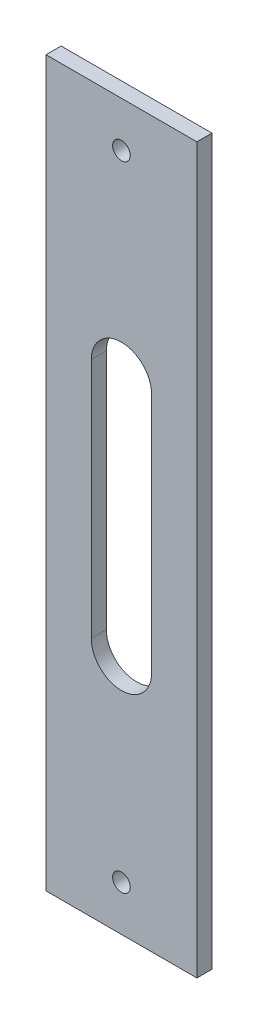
ISO-10303-21;
HEADER;
FILE_DESCRIPTION(('STEP AP214'),'2;1');
FILE_NAME('part.step','',(''),(''),'','','');
FILE_SCHEMA(('AUTOMOTIVE_DESIGN { 1 0 10303 214 1 1 1 1 }'));
ENDSEC;
DATA;
#1=APPLICATION_CONTEXT('core data for automotive mechanical design processes');
#2=APPLICATION_PROTOCOL_DEFINITION('international standard','automotive_design',2000,#1);
#3=PRODUCT_CONTEXT('',#1,'mechanical');
#4=PRODUCT('Part','Part','',(#3));
#5=PRODUCT_RELATED_PRODUCT_CATEGORY('part','',(#4));
#6=PRODUCT_DEFINITION_FORMATION('','',#4);
#7=PRODUCT_DEFINITION_CONTEXT('part definition',#1,'design');
#8=PRODUCT_DEFINITION('design','',#6,#7);
#9=PRODUCT_DEFINITION_SHAPE('','',#8);
#10=(LENGTH_UNIT() NAMED_UNIT(*) SI_UNIT(.MILLI.,.METRE.));
#11=(NAMED_UNIT(*) PLANE_ANGLE_UNIT() SI_UNIT($,.RADIAN.));
#12=(NAMED_UNIT(*) SI_UNIT($,.STERADIAN.) SOLID_ANGLE_UNIT());
#13=UNCERTAINTY_MEASURE_WITH_UNIT(LENGTH_MEASURE(1.E-05),#10,'distance_accuracy_value','');
#14=(GEOMETRIC_REPRESENTATION_CONTEXT(3) GLOBAL_UNCERTAINTY_ASSIGNED_CONTEXT((#13)) GLOBAL_UNIT_ASSIGNED_CONTEXT((#10,
#11,#12)) REPRESENTATION_CONTEXT('',''));
#15=CARTESIAN_POINT('',(0.,0.,0.));
#16=DIRECTION('',(0.,0.,1.));
#17=DIRECTION('',(1.,0.,0.));
#18=AXIS2_PLACEMENT_3D('',#15,#16,#17);
#19=CARTESIAN_POINT('',(7.93749999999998,-38.1,79.4235817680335));
#20=DIRECTION('',(-1.,0.,0.));
#21=DIRECTION('',(0.,0.,1.));
#22=AXIS2_PLACEMENT_3D('',#19,#20,#21);
#23=PLANE('',#22);
#24=DIRECTION('',(0.,1.,0.));
#25=VECTOR('',#24,1.);
#26=CARTESIAN_POINT('',(7.93749999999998,-38.1,1.58749999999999));
#27=LINE('',#26,#25);
#28=CARTESIAN_POINT('',(7.93749999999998,-38.1,1.58749999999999));
#29=VERTEX_POINT('',#28);
#30=CARTESIAN_POINT('',(7.93749999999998,38.1,1.58749999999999));
#31=VERTEX_POINT('',#30);
#32=EDGE_CURVE('E157',#29,#31,#27,.T.);
#33=ORIENTED_EDGE('',*,*,#32,.F.);
#34=DIRECTION('',(0.,0.,-1.));
#35=VECTOR('',#34,1.);
#36=CARTESIAN_POINT('',(7.93749999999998,-38.1,79.4235817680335));
#37=LINE('',#36,#35);
#38=CARTESIAN_POINT('',(7.93749999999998,-38.1,0.));
#39=VERTEX_POINT('',#38);
#40=EDGE_CURVE('E36',#29,#39,#37,.T.);
#41=ORIENTED_EDGE('',*,*,#40,.T.);
#42=DIRECTION('',(0.,1.,0.));
#43=VECTOR('',#42,1.);
#44=CARTESIAN_POINT('',(7.93749999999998,-38.1,0.));
#45=LINE('',#44,#43);
#46=CARTESIAN_POINT('',(7.93749999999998,38.1,0.));
#47=VERTEX_POINT('',#46);
#48=EDGE_CURVE('E152',#39,#47,#45,.T.);
#49=ORIENTED_EDGE('',*,*,#48,.T.);
#50=DIRECTION('',(0.,0.,-1.));
#51=VECTOR('',#50,1.);
#52=CARTESIAN_POINT('',(7.93749999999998,38.1,79.4235817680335));
#53=LINE('',#52,#51);
#54=EDGE_CURVE('E151',#31,#47,#53,.T.);
#55=ORIENTED_EDGE('',*,*,#54,.F.);
#56=EDGE_LOOP('',(#33,#41,#49,#55));
#57=FACE_BOUND('',#56,.T.);
#58=ADVANCED_FACE('F32',(#57),#23,.F.);
#59=CARTESIAN_POINT('',(7.93749999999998,38.1,79.4235817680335));
#60=DIRECTION('',(0.,-1.,0.));
#61=DIRECTION('',(0.,0.,-1.));
#62=AXIS2_PLACEMENT_3D('',#59,#60,#61);
#63=PLANE('',#62);
#64=DIRECTION('',(-1.,0.,0.));
#65=VECTOR('',#64,1.);
#66=CARTESIAN_POINT('',(7.93749999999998,38.1,1.58749999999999));
#67=LINE('',#66,#65);
#68=CARTESIAN_POINT('',(-7.9375,38.1,1.58749999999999));
#69=VERTEX_POINT('',#68);
#70=EDGE_CURVE('E41',#31,#69,#67,.T.);
#71=ORIENTED_EDGE('',*,*,#70,.F.);
#72=ORIENTED_EDGE('',*,*,#54,.T.);
#73=DIRECTION('',(-1.,0.,0.));
#74=VECTOR('',#73,1.);
#75=CARTESIAN_POINT('',(7.93749999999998,38.1,0.));
#76=LINE('',#75,#74);
#77=CARTESIAN_POINT('',(-7.9375,38.1,0.));
#78=VERTEX_POINT('',#77);
#79=EDGE_CURVE('E148',#47,#78,#76,.T.);
#80=ORIENTED_EDGE('',*,*,#79,.T.);
#81=DIRECTION('',(0.,0.,-1.));
#82=VECTOR('',#81,1.);
#83=CARTESIAN_POINT('',(-7.9375,38.1,79.4235817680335));
#84=LINE('',#83,#82);
#85=EDGE_CURVE('E147',#69,#78,#84,.T.);
#86=ORIENTED_EDGE('',*,*,#85,.F.);
#87=EDGE_LOOP('',(#71,#72,#80,#86));
#88=FACE_BOUND('',#87,.T.);
#89=ADVANCED_FACE('F178',(#88),#63,.F.);
#90=CARTESIAN_POINT('',(-7.9375,-38.1,79.4235817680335));
#91=DIRECTION('',(1.,0.,0.));
#92=DIRECTION('',(0.,0.,-1.));
#93=AXIS2_PLACEMENT_3D('',#90,#91,#92);
#94=PLANE('',#93);
#95=DIRECTION('',(0.,-1.,0.));
#96=VECTOR('',#95,1.);
#97=CARTESIAN_POINT('',(-7.9375,-38.1,1.58749999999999));
#98=LINE('',#97,#96);
#99=CARTESIAN_POINT('',(-7.9375,-38.1,1.58749999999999));
#100=VERTEX_POINT('',#99);
#101=EDGE_CURVE('E11',#69,#100,#98,.T.);
#102=ORIENTED_EDGE('',*,*,#101,.F.);
#103=ORIENTED_EDGE('',*,*,#85,.T.);
#104=DIRECTION('',(0.,-1.,0.));
#105=VECTOR('',#104,1.);
#106=CARTESIAN_POINT('',(-7.9375,-38.1,0.));
#107=LINE('',#106,#105);
#108=CARTESIAN_POINT('',(-7.9375,-38.1,0.));
#109=VERTEX_POINT('',#108);
#110=EDGE_CURVE('E144',#78,#109,#107,.T.);
#111=ORIENTED_EDGE('',*,*,#110,.T.);
#112=DIRECTION('',(0.,0.,-1.));
#113=VECTOR('',#112,1.);
#114=CARTESIAN_POINT('',(-7.9375,-38.1,79.4235817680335));
#115=LINE('',#114,#113);
#116=EDGE_CURVE('E143',#100,#109,#115,.T.);
#117=ORIENTED_EDGE('',*,*,#116,.F.);
#118=EDGE_LOOP('',(#102,#103,#111,#117));
#119=FACE_BOUND('',#118,.T.);
#120=ADVANCED_FACE('F170',(#119),#94,.F.);
#121=CARTESIAN_POINT('',(7.93749999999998,-38.1,79.4235817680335));
#122=DIRECTION('',(0.,1.,0.));
#123=DIRECTION('',(0.,0.,1.));
#124=AXIS2_PLACEMENT_3D('',#121,#122,#123);
#125=PLANE('',#124);
#126=DIRECTION('',(1.,0.,0.));
#127=VECTOR('',#126,1.);
#128=CARTESIAN_POINT('',(7.93749999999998,-38.1,1.58749999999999));
#129=LINE('',#128,#127);
#130=EDGE_CURVE('E142',#100,#29,#129,.T.);
#131=ORIENTED_EDGE('',*,*,#130,.F.);
#132=ORIENTED_EDGE('',*,*,#116,.T.);
#133=DIRECTION('',(1.,0.,0.));
#134=VECTOR('',#133,1.);
#135=CARTESIAN_POINT('',(7.93749999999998,-38.1,0.));
#136=LINE('',#135,#134);
#137=EDGE_CURVE('E139',#109,#39,#136,.T.);
#138=ORIENTED_EDGE('',*,*,#137,.T.);
#139=ORIENTED_EDGE('',*,*,#40,.F.);
#140=EDGE_LOOP('',(#131,#132,#138,#139));
#141=FACE_BOUND('',#140,.T.);
#142=ADVANCED_FACE('F165',(#141),#125,.F.);
#143=CARTESIAN_POINT('',(7.93749999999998,38.1,0.));
#144=DIRECTION('',(0.,0.,1.));
#145=DIRECTION('',(1.,0.,0.));
#146=AXIS2_PLACEMENT_3D('',#143,#144,#145);
#147=PLANE('',#146);
#148=CARTESIAN_POINT('',(0.,-33.3375,0.));
#149=DIRECTION('',(0.,0.,1.));
#150=DIRECTION('',(1.,0.,0.));
#151=AXIS2_PLACEMENT_3D('',#148,#149,#150);
#152=CIRCLE('',#151,0.927099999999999);
#153=CARTESIAN_POINT('',(0.927099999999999,-33.3375,0.));
#154=VERTEX_POINT('',#153);
#155=EDGE_CURVE('E215',#154,#154,#152,.T.);
#156=ORIENTED_EDGE('',*,*,#155,.T.);
#157=EDGE_LOOP('',(#156));
#158=FACE_BOUND('',#157,.T.);
#159=CARTESIAN_POINT('',(0.,33.3375,0.));
#160=DIRECTION('',(0.,0.,1.));
#161=DIRECTION('',(1.,0.,0.));
#162=AXIS2_PLACEMENT_3D('',#159,#160,#161);
#163=CIRCLE('',#162,0.927099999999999);
#164=CARTESIAN_POINT('',(0.927100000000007,33.3375,0.));
#165=VERTEX_POINT('',#164);
#166=EDGE_CURVE('E130',#165,#165,#163,.T.);
#167=ORIENTED_EDGE('',*,*,#166,.T.);
#168=EDGE_LOOP('',(#167));
#169=FACE_BOUND('',#168,.T.);
#170=DIRECTION('',(0.,-1.,0.));
#171=VECTOR('',#170,1.);
#172=CARTESIAN_POINT('',(-3.175,-12.7,0.));
#173=LINE('',#172,#171);
#174=CARTESIAN_POINT('',(-3.175,12.7,0.));
#175=VERTEX_POINT('',#174);
#176=CARTESIAN_POINT('',(-3.175,-12.7,0.));
#177=VERTEX_POINT('',#176);
#178=EDGE_CURVE('E107',#175,#177,#173,.T.);
#179=ORIENTED_EDGE('',*,*,#178,.T.);
#180=CARTESIAN_POINT('',(0.,-12.7,0.));
#181=DIRECTION('',(0.,0.,1.));
#182=DIRECTION('',(-1.,0.,0.));
#183=AXIS2_PLACEMENT_3D('',#180,#181,#182);
#184=CIRCLE('',#183,3.175);
#185=CARTESIAN_POINT('',(3.175,-12.7,0.));
#186=VERTEX_POINT('',#185);
#187=EDGE_CURVE('E101',#177,#186,#184,.T.);
#188=ORIENTED_EDGE('',*,*,#187,.T.);
#189=DIRECTION('',(0.,1.,0.));
#190=VECTOR('',#189,1.);
#191=CARTESIAN_POINT('',(3.175,12.7,0.));
#192=LINE('',#191,#190);
#193=CARTESIAN_POINT('',(3.175,12.7,0.));
#194=VERTEX_POINT('',#193);
#195=EDGE_CURVE('E110',#186,#194,#192,.T.);
#196=ORIENTED_EDGE('',*,*,#195,.T.);
#197=CARTESIAN_POINT('',(0.,12.7,0.));
#198=DIRECTION('',(0.,0.,1.));
#199=DIRECTION('',(-1.,0.,0.));
#200=AXIS2_PLACEMENT_3D('',#197,#198,#199);
#201=CIRCLE('',#200,3.175);
#202=EDGE_CURVE('E49',#194,#175,#201,.T.);
#203=ORIENTED_EDGE('',*,*,#202,.T.);
#204=EDGE_LOOP('',(#179,#188,#196,#203));
#205=FACE_BOUND('',#204,.T.);
#206=ORIENTED_EDGE('',*,*,#48,.F.);
#207=ORIENTED_EDGE('',*,*,#137,.F.);
#208=ORIENTED_EDGE('',*,*,#110,.F.);
#209=ORIENTED_EDGE('',*,*,#79,.F.);
#210=EDGE_LOOP('',(#206,#207,#208,#209));
#211=FACE_BOUND('',#210,.T.);
#212=ADVANCED_FACE('F114',(#158,#169,#205,#211),#147,.F.);
#213=CARTESIAN_POINT('',(0.,114.3,1.5875));
#214=DIRECTION('',(0.,0.,1.));
#215=DIRECTION('',(0.,1.,0.));
#216=AXIS2_PLACEMENT_3D('',#213,#214,#215);
#217=PLANE('',#216);
#218=CARTESIAN_POINT('',(0.,-33.3375,1.5875));
#219=DIRECTION('',(0.,0.,1.));
#220=DIRECTION('',(1.,0.,0.));
#221=AXIS2_PLACEMENT_3D('',#218,#219,#220);
#222=CIRCLE('',#221,0.927099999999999);
#223=CARTESIAN_POINT('',(0.927099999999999,-33.3375,1.5875));
#224=VERTEX_POINT('',#223);
#225=EDGE_CURVE('E218',#224,#224,#222,.T.);
#226=ORIENTED_EDGE('',*,*,#225,.F.);
#227=EDGE_LOOP('',(#226));
#228=FACE_BOUND('',#227,.T.);
#229=CARTESIAN_POINT('',(0.,33.3375,1.5875));
#230=DIRECTION('',(0.,0.,1.));
#231=DIRECTION('',(1.,0.,0.));
#232=AXIS2_PLACEMENT_3D('',#229,#230,#231);
#233=CIRCLE('',#232,0.927099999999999);
#234=CARTESIAN_POINT('',(0.927100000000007,33.3375,1.5875));
#235=VERTEX_POINT('',#234);
#236=EDGE_CURVE('E123',#235,#235,#233,.T.);
#237=ORIENTED_EDGE('',*,*,#236,.F.);
#238=EDGE_LOOP('',(#237));
#239=FACE_BOUND('',#238,.T.);
#240=CARTESIAN_POINT('',(0.,-12.7,1.5875));
#241=DIRECTION('',(0.,0.,1.));
#242=DIRECTION('',(-1.,0.,0.));
#243=AXIS2_PLACEMENT_3D('',#240,#241,#242);
#244=CIRCLE('',#243,3.175);
#245=CARTESIAN_POINT('',(-3.175,-12.7,1.5875));
#246=VERTEX_POINT('',#245);
#247=CARTESIAN_POINT('',(3.175,-12.7,1.5875));
#248=VERTEX_POINT('',#247);
#249=EDGE_CURVE('E57',#246,#248,#244,.T.);
#250=ORIENTED_EDGE('',*,*,#249,.F.);
#251=DIRECTION('',(0.,-1.,0.));
#252=VECTOR('',#251,1.);
#253=CARTESIAN_POINT('',(-3.175,-12.7,1.5875));
#254=LINE('',#253,#252);
#255=CARTESIAN_POINT('',(-3.175,12.7,1.5875));
#256=VERTEX_POINT('',#255);
#257=EDGE_CURVE('E117',#256,#246,#254,.T.);
#258=ORIENTED_EDGE('',*,*,#257,.F.);
#259=CARTESIAN_POINT('',(0.,12.7,1.5875));
#260=DIRECTION('',(0.,0.,1.));
#261=DIRECTION('',(-1.,0.,0.));
#262=AXIS2_PLACEMENT_3D('',#259,#260,#261);
#263=CIRCLE('',#262,3.175);
#264=CARTESIAN_POINT('',(3.175,12.7,1.5875));
#265=VERTEX_POINT('',#264);
#266=EDGE_CURVE('E120',#265,#256,#263,.T.);
#267=ORIENTED_EDGE('',*,*,#266,.F.);
#268=DIRECTION('',(0.,1.,0.));
#269=VECTOR('',#268,1.);
#270=CARTESIAN_POINT('',(3.175,12.7,1.5875));
#271=LINE('',#270,#269);
#272=EDGE_CURVE('E129',#248,#265,#271,.T.);
#273=ORIENTED_EDGE('',*,*,#272,.F.);
#274=EDGE_LOOP('',(#250,#258,#267,#273));
#275=FACE_BOUND('',#274,.T.);
#276=ORIENTED_EDGE('',*,*,#130,.T.);
#277=ORIENTED_EDGE('',*,*,#32,.T.);
#278=ORIENTED_EDGE('',*,*,#70,.T.);
#279=ORIENTED_EDGE('',*,*,#101,.T.);
#280=EDGE_LOOP('',(#276,#277,#278,#279));
#281=FACE_BOUND('',#280,.T.);
#282=ADVANCED_FACE('F34',(#228,#239,#275,#281),#217,.T.);
#283=CARTESIAN_POINT('',(0.,-12.7,0.));
#284=DIRECTION('',(0.,0.,1.));
#285=DIRECTION('',(1.,0.,0.));
#286=AXIS2_PLACEMENT_3D('',#283,#284,#285);
#287=CYLINDRICAL_SURFACE('',#286,3.175);
#288=ORIENTED_EDGE('',*,*,#249,.T.);
#289=DIRECTION('',(0.,0.,1.));
#290=VECTOR('',#289,1.);
#291=CARTESIAN_POINT('',(3.175,-12.7,0.));
#292=LINE('',#291,#290);
#293=EDGE_CURVE('E97',#186,#248,#292,.T.);
#294=ORIENTED_EDGE('',*,*,#293,.F.);
#295=ORIENTED_EDGE('',*,*,#187,.F.);
#296=DIRECTION('',(0.,0.,1.));
#297=VECTOR('',#296,1.);
#298=CARTESIAN_POINT('',(-3.175,-12.7,0.));
#299=LINE('',#298,#297);
#300=EDGE_CURVE('E134',#177,#246,#299,.T.);
#301=ORIENTED_EDGE('',*,*,#300,.T.);
#302=EDGE_LOOP('',(#288,#294,#295,#301));
#303=FACE_BOUND('',#302,.T.);
#304=ADVANCED_FACE('F99',(#303),#287,.F.);
#305=CARTESIAN_POINT('',(-3.175,-12.7,0.));
#306=DIRECTION('',(-1.,0.,0.));
#307=DIRECTION('',(0.,0.,1.));
#308=AXIS2_PLACEMENT_3D('',#305,#306,#307);
#309=PLANE('',#308);
#310=ORIENTED_EDGE('',*,*,#257,.T.);
#311=ORIENTED_EDGE('',*,*,#300,.F.);
#312=ORIENTED_EDGE('',*,*,#178,.F.);
#313=DIRECTION('',(0.,0.,1.));
#314=VECTOR('',#313,1.);
#315=CARTESIAN_POINT('',(-3.175,12.7,0.));
#316=LINE('',#315,#314);
#317=EDGE_CURVE('E136',#175,#256,#316,.T.);
#318=ORIENTED_EDGE('',*,*,#317,.T.);
#319=EDGE_LOOP('',(#310,#311,#312,#318));
#320=FACE_BOUND('',#319,.T.);
#321=ADVANCED_FACE('F194',(#320),#309,.F.);
#322=CARTESIAN_POINT('',(0.,12.7,0.));
#323=DIRECTION('',(0.,0.,1.));
#324=DIRECTION('',(1.,0.,0.));
#325=AXIS2_PLACEMENT_3D('',#322,#323,#324);
#326=CYLINDRICAL_SURFACE('',#325,3.175);
#327=ORIENTED_EDGE('',*,*,#266,.T.);
#328=ORIENTED_EDGE('',*,*,#317,.F.);
#329=ORIENTED_EDGE('',*,*,#202,.F.);
#330=DIRECTION('',(0.,0.,1.));
#331=VECTOR('',#330,1.);
#332=CARTESIAN_POINT('',(3.175,12.7,0.));
#333=LINE('',#332,#331);
#334=EDGE_CURVE('E106',#194,#265,#333,.T.);
#335=ORIENTED_EDGE('',*,*,#334,.T.);
#336=EDGE_LOOP('',(#327,#328,#329,#335));
#337=FACE_BOUND('',#336,.T.);
#338=ADVANCED_FACE('F198',(#337),#326,.F.);
#339=CARTESIAN_POINT('',(3.175,12.7,0.));
#340=DIRECTION('',(1.,0.,0.));
#341=DIRECTION('',(0.,0.,-1.));
#342=AXIS2_PLACEMENT_3D('',#339,#340,#341);
#343=PLANE('',#342);
#344=ORIENTED_EDGE('',*,*,#272,.T.);
#345=ORIENTED_EDGE('',*,*,#334,.F.);
#346=ORIENTED_EDGE('',*,*,#195,.F.);
#347=ORIENTED_EDGE('',*,*,#293,.T.);
#348=EDGE_LOOP('',(#344,#345,#346,#347));
#349=FACE_BOUND('',#348,.T.);
#350=ADVANCED_FACE('F111',(#349),#343,.F.);
#351=CARTESIAN_POINT('',(0.,33.3375,0.));
#352=DIRECTION('',(0.,0.,1.));
#353=DIRECTION('',(1.,0.,0.));
#354=AXIS2_PLACEMENT_3D('',#351,#352,#353);
#355=CYLINDRICAL_SURFACE('',#354,0.927099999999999);
#356=ORIENTED_EDGE('',*,*,#166,.F.);
#357=EDGE_LOOP('',(#356));
#358=FACE_BOUND('',#357,.T.);
#359=ORIENTED_EDGE('',*,*,#236,.T.);
#360=EDGE_LOOP('',(#359));
#361=FACE_BOUND('',#360,.T.);
#362=ADVANCED_FACE('F197',(#358,#361),#355,.F.);
#363=CARTESIAN_POINT('',(0.,-33.3375,0.));
#364=DIRECTION('',(0.,0.,1.));
#365=DIRECTION('',(1.,0.,0.));
#366=AXIS2_PLACEMENT_3D('',#363,#364,#365);
#367=CYLINDRICAL_SURFACE('',#366,0.927099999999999);
#368=ORIENTED_EDGE('',*,*,#155,.F.);
#369=EDGE_LOOP('',(#368));
#370=FACE_BOUND('',#369,.T.);
#371=ORIENTED_EDGE('',*,*,#225,.T.);
#372=EDGE_LOOP('',(#371));
#373=FACE_BOUND('',#372,.T.);
#374=ADVANCED_FACE('F206',(#370,#373),#367,.F.);
#375=CLOSED_SHELL('',(#58,#89,#120,#142,#212,#282,#304,#321,#338,#350,#362,#374));
#376=MANIFOLD_SOLID_BREP('B2',#375);
#377=ADVANCED_BREP_SHAPE_REPRESENTATION('',(#18,#376),#14);
#378=SHAPE_DEFINITION_REPRESENTATION(#9,#377);
ENDSEC;
END-ISO-10303-21;
